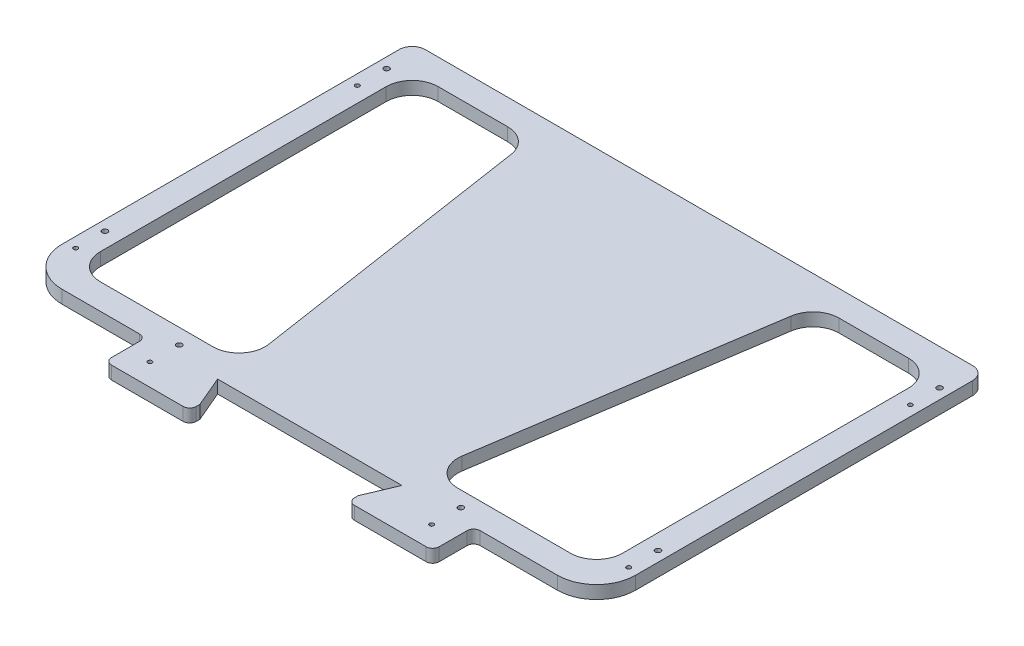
from build123d import *

# Parameters (mm, degrees)
SKETCH1_W                  = 560
SKETCH1_H                  = 380
BOSS_EXTRUDE1_DEPTH        = 12.7
FILLET1_R                  = 38.1
M5_CLEARANCE_HOLE1_D       = 5.3
M5_CLEARANCE_HOLE2_D       = 5.3
CUT_EXTRUDE1_DEPTH         = 677.876126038
FILLET2_R                  = 12.7
SKETCH7_W                  = 320
SKETCH7_H                  = 12.7
BOSS_EXTRUDE2_DEPTH        = 40
FILLET3_R                  = 6.35
CUT_EXTRUDE2_REACH         = 678.876
F_4_2_4_2_DIAMETER_HOLE1_D = 4.2
FILLET4_R                  = 6.35


with BuildPart() as part:
    # Sketch1 → Boss-Extrude1 (new body)
    with BuildSketch(Plane(origin=(0, 0, 0), x_dir=(1, 0, 0), z_dir=(0, 1, 0))):
        with Locations((280, 190)):
            Rectangle(SKETCH1_W, SKETCH1_H)
    extrude(amount=BOSS_EXTRUDE1_DEPTH)

    # Fillet1
    fillet1_edges = [part.edges().sort_by_distance(p)[0] for p in [
        (560, 6.35, 0),
        (0, 6.35, 0),
    ]]
    fillet(fillet1_edges, radius=FILLET1_R)

    # M5 Clearance Hole1 (through all)
    with Locations(Plane(origin=(0, 12.7, 0), x_dir=(1, 0, 0), z_dir=(0, 1, 0))):
        with Locations((142.5, 10), (417.5, 10)):
            Hole(M5_CLEARANCE_HOLE1_D / 2)

    # M5 Clearance Hole2 (through all)
    with Locations(Plane(origin=(0, 12.7, 0), x_dir=(1, 0, 0), z_dir=(0, 1, 0))):
        with Locations((10, 70), (10, 345), (550, 345), (550, 70)):
            Hole(M5_CLEARANCE_HOLE2_D / 2)

    # Sketch6 → Cut-Extrude1 (cut, through all)
    with BuildSketch(Plane(origin=(0, 12.7, 0), x_dir=(1, 0, 0), z_dir=(0, 1, 0))):
        with BuildLine():
            Line((25, 329.6), (25, 50.4))
            ThreePointArc((25, 50.4), (32.439487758, 32.439487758), (50.4, 25))
            Line((50.4, 25), (160.461617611, 25))
            ThreePointArc((160.461617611, 25), (179.720491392, 33.839330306), (185.574991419, 54.205056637))
            Line((185.574991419, 54.205056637), (143.271961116, 333.405056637))
            ThreePointArc((143.271961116, 333.405056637), (134.719257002, 348.858873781), (118.158587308, 355))
            Line((118.158587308, 355), (50.4, 355))
            ThreePointArc((50.4, 355), (32.439487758, 347.560512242), (25, 329.6))
        make_face()
        with BuildLine():
            Line((441.841412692, 355), (509.6, 355))
            ThreePointArc((509.6, 355), (527.560512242, 347.560512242), (535, 329.6))
            Line((535, 329.6), (535, 50.4))
            ThreePointArc((535, 50.4), (527.560512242, 32.439487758), (509.6, 25))
            Line((509.6, 25), (399.538382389, 25))
            ThreePointArc((399.538382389, 25), (380.279508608, 33.839330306), (374.425008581, 54.205056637))
            Line((374.425008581, 54.205056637), (416.728038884, 333.405056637))
            ThreePointArc((416.728038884, 333.405056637), (425.280742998, 348.858873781), (441.841412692, 355))
        make_face()
    extrude(amount=-CUT_EXTRUDE1_DEPTH, mode=Mode.SUBTRACT)

    # Fillet2
    fillet2_edges = [part.edges().sort_by_distance(p)[0] for p in [
        (0, 6.35, -380),
        (560, 6.35, -380),
    ]]
    fillet(fillet2_edges, radius=FILLET2_R)

    # Sketch7 → Boss-Extrude2 (add)
    with BuildSketch(Plane.XY):
        with Locations((280, 6.35)):
            Rectangle(SKETCH7_W, SKETCH7_H)
    extrude(amount=BOSS_EXTRUDE2_DEPTH)

    # Fillet3
    fillet3_edges = [part.edges().sort_by_distance(p)[0] for p in [
        (120, 6.35, 0),
        (440, 6.35, 0),
        (120, 6.35, 40),
        (440, 6.35, 40),
    ]]
    fillet(fillet3_edges, radius=FILLET3_R)

    # Sketch8 → Cut-Extrude2 (cut, up to next)
    with BuildSketch(Plane(origin=(0, 12.7, 0), x_dir=(1, 0, 0), z_dir=(0, 1, 0)), mode=Mode.PRIVATE) as cut_extrude2_sk1:
        Polygon((370, 0), (357.265755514, -30), (357.265755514, -40), (202.734244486, -40), (202.734244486, -30), (190, 0), align=None)
    cut_extrude2_tool1 = extrude(cut_extrude2_sk1.sketch, amount=-CUT_EXTRUDE2_REACH, mode=Mode.PRIVATE) & part.part
    add(cut_extrude2_tool1.solids().sort_by_distance((280, 12.7, 19.417933))[0], mode=Mode.SUBTRACT)

    # 4.2 _4.2_ Diameter Hole1 (through all)
    with Locations(Plane(origin=(0, 12.7, 0), x_dir=(1, 0, 0), z_dir=(0, 1, 0))):
        with Locations((10, 316.425), (10, 41.425), (142.5, -18.575), (417.5, -18.575), (550, 41.425), (550, 316.425)):
            Hole(F_4_2_4_2_DIAMETER_HOLE1_D / 2)

    # Fillet4
    fillet4_edges = [part.edges().sort_by_distance(p)[0] for p in [
        (357.265755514, 6.35, 40),
        (202.734244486, 6.35, 40),
    ]]
    fillet(fillet4_edges, radius=FILLET4_R)


solid = part.part
